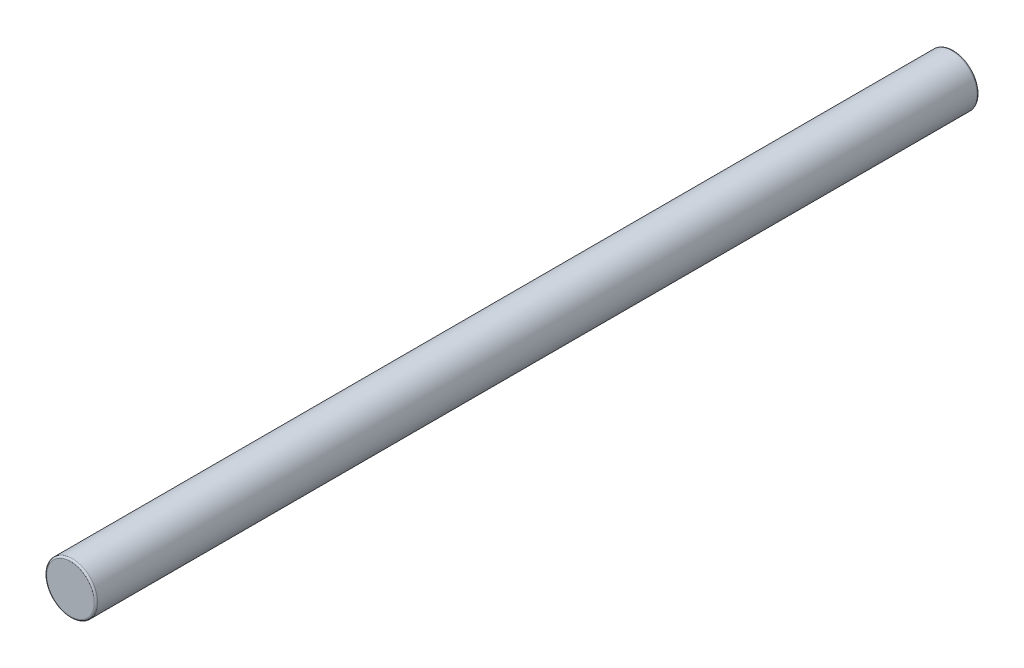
from build123d import *

# Parameters (mm, degrees)
ESQUISSE1_R      = 1.5
EXTRUSION1_DEPTH = 52
CONG_1_R         = 0.1


with BuildPart() as part:
    # Esquisse1 → Extrusion1 (new body)
    with BuildSketch(Plane.XY):
        with Locations(Location((0, 0, 0), (0, 0, 180))):
            Circle(ESQUISSE1_R)
    extrude(amount=EXTRUSION1_DEPTH)

    # Cong_1
    cong_1_edges = [part.edges().sort_by_distance(p)[0] for p in [
        (1.5, 0, 0),
        (1.5, 0, 52),
    ]]
    fillet(cong_1_edges, radius=CONG_1_R)


solid = part.part
